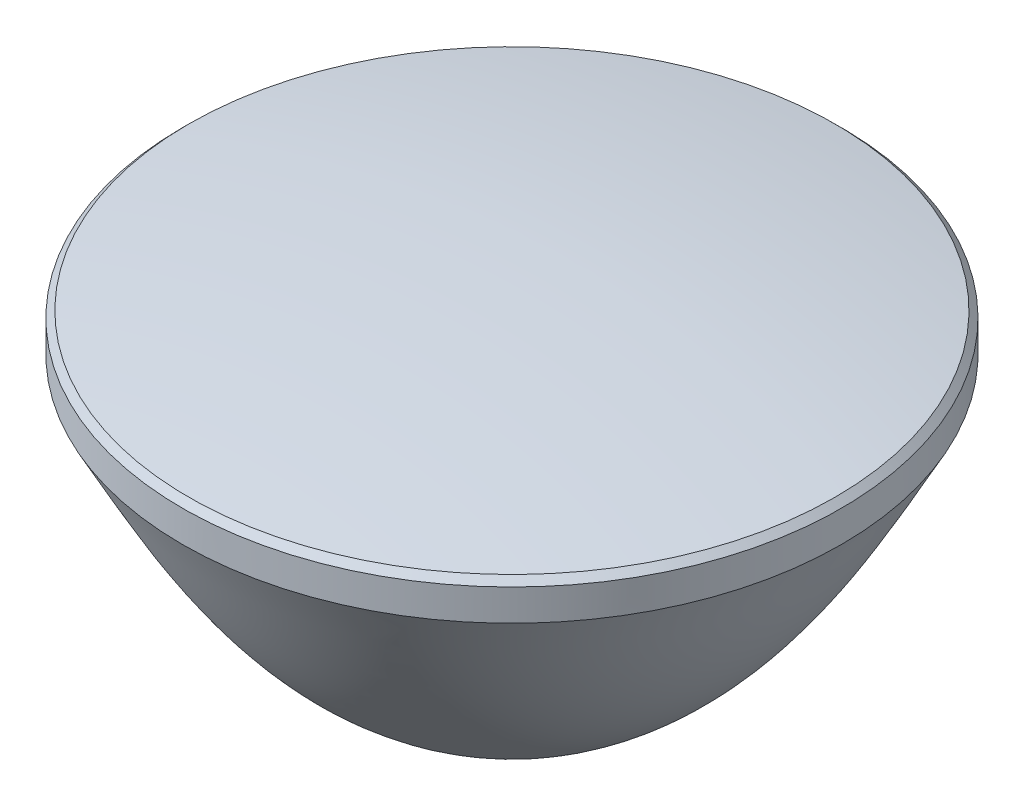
ISO-10303-21;
HEADER;
FILE_DESCRIPTION(('STEP AP214'),'2;1');
FILE_NAME('part.step','',(''),(''),'','','');
FILE_SCHEMA(('AUTOMOTIVE_DESIGN { 1 0 10303 214 1 1 1 1 }'));
ENDSEC;
DATA;
#1=APPLICATION_CONTEXT('core data for automotive mechanical design processes');
#2=APPLICATION_PROTOCOL_DEFINITION('international standard','automotive_design',2000,#1);
#3=PRODUCT_CONTEXT('',#1,'mechanical');
#4=PRODUCT('Part','Part','',(#3));
#5=PRODUCT_RELATED_PRODUCT_CATEGORY('part','',(#4));
#6=PRODUCT_DEFINITION_FORMATION('','',#4);
#7=PRODUCT_DEFINITION_CONTEXT('part definition',#1,'design');
#8=PRODUCT_DEFINITION('design','',#6,#7);
#9=PRODUCT_DEFINITION_SHAPE('','',#8);
#10=(LENGTH_UNIT() NAMED_UNIT(*) SI_UNIT(.MILLI.,.METRE.));
#11=(NAMED_UNIT(*) PLANE_ANGLE_UNIT() SI_UNIT($,.RADIAN.));
#12=(NAMED_UNIT(*) SI_UNIT($,.STERADIAN.) SOLID_ANGLE_UNIT());
#13=UNCERTAINTY_MEASURE_WITH_UNIT(LENGTH_MEASURE(1.E-05),#10,'distance_accuracy_value','');
#14=(GEOMETRIC_REPRESENTATION_CONTEXT(3) GLOBAL_UNCERTAINTY_ASSIGNED_CONTEXT((#13)) GLOBAL_UNIT_ASSIGNED_CONTEXT((#10,
#11,#12)) REPRESENTATION_CONTEXT('',''));
#15=CARTESIAN_POINT('',(0.,0.,0.));
#16=DIRECTION('',(0.,0.,1.));
#17=DIRECTION('',(1.,0.,0.));
#18=AXIS2_PLACEMENT_3D('',#15,#16,#17);
#19=CARTESIAN_POINT('',(2.0019960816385E-10,14.,0.));
#20=DIRECTION('',(0.,1.,0.));
#21=DIRECTION('',(-1.,0.,0.));
#22=AXIS2_PLACEMENT_3D('',#19,#20,#21);
#23=CYLINDRICAL_SURFACE('',#22,12.6999999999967);
#24=CARTESIAN_POINT('',(2.00199923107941E-10,11.4282863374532,0.));
#25=DIRECTION('',(0.,1.,0.));
#26=DIRECTION('',(-1.,0.,0.));
#27=AXIS2_PLACEMENT_3D('',#24,#25,#26);
#28=CIRCLE('',#27,12.6999999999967);
#29=CARTESIAN_POINT('',(-12.6999999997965,11.4282863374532,0.));
#30=VERTEX_POINT('',#29);
#31=EDGE_CURVE('E11',#30,#30,#28,.T.);
#32=ORIENTED_EDGE('',*,*,#31,.T.);
#33=EDGE_LOOP('',(#32));
#34=FACE_BOUND('',#33,.T.);
#35=CARTESIAN_POINT('',(2.00199774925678E-10,12.6382863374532,0.));
#36=DIRECTION('',(0.,1.,0.));
#37=DIRECTION('',(-1.,0.,0.));
#38=AXIS2_PLACEMENT_3D('',#35,#36,#37);
#39=CIRCLE('',#38,12.7000000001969);
#40=CARTESIAN_POINT('',(-12.6999999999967,12.6382863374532,0.));
#41=VERTEX_POINT('',#40);
#42=EDGE_CURVE('E38',#41,#41,#39,.T.);
#43=ORIENTED_EDGE('',*,*,#42,.F.);
#44=EDGE_LOOP('',(#43));
#45=FACE_BOUND('',#44,.T.);
#46=ADVANCED_FACE('F17',(#34,#45),#23,.T.);
#47=CARTESIAN_POINT('',(0.,0.,0.));
#48=CARTESIAN_POINT('',(0.065053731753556,0.,0.));
#49=CARTESIAN_POINT('',(0.195269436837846,0.0017506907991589,0.));
#50=CARTESIAN_POINT('',(0.488270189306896,0.00962874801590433,0.));
#51=CARTESIAN_POINT('',(0.741379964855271,0.0306050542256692,0.));
#52=CARTESIAN_POINT('',(1.07409762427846,0.0619892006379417,0.));
#53=CARTESIAN_POINT('',(1.3577041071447,0.103687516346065,0.));
#54=CARTESIAN_POINT('',(1.66844163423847,0.155573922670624,0.));
#55=CARTESIAN_POINT('',(1.95998957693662,0.21749890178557,0.));
#56=CARTESIAN_POINT('',(2.2597015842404,0.289279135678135,0.));
#57=CARTESIAN_POINT('',(2.55069587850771,0.370720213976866,0.));
#58=CARTESIAN_POINT('',(2.84254882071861,0.461585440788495,0.));
#59=CARTESIAN_POINT('',(3.12932504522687,0.561653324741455,0.));
#60=CARTESIAN_POINT('',(3.48495778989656,0.697880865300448,0.));
#61=CARTESIAN_POINT('',(3.90410862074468,0.878713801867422,0.));
#62=CARTESIAN_POINT('',(4.38254068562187,1.11365618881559,0.));
#63=CARTESIAN_POINT('',(4.91294921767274,1.41286859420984,0.));
#64=CARTESIAN_POINT('',(5.42643349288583,1.74019360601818,0.));
#65=CARTESIAN_POINT('',(5.9224420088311,2.09363807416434,0.));
#66=CARTESIAN_POINT('',(6.40055239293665,2.47040718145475,0.));
#67=CARTESIAN_POINT('',(6.86113542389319,2.86918499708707,0.));
#68=CARTESIAN_POINT('',(7.37128169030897,3.35033810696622,0.));
#69=CARTESIAN_POINT('',(7.96395224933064,3.96710957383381,0.));
#70=CARTESIAN_POINT('',(8.51936396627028,4.61333986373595,0.));
#71=CARTESIAN_POINT('',(9.04500836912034,5.29087908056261,0.));
#72=CARTESIAN_POINT('',(9.48682424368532,5.90433063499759,0.));
#73=CARTESIAN_POINT('',(9.83359792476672,6.41467985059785,0.));
#74=CARTESIAN_POINT('',(10.2404360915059,7.03968536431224,0.));
#75=CARTESIAN_POINT('',(10.7301806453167,7.84327691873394,0.));
#76=CARTESIAN_POINT('',(11.2373721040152,8.72353009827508,0.));
#77=CARTESIAN_POINT('',(11.7837409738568,9.72409723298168,0.));
#78=CARTESIAN_POINT('',(12.1634222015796,10.4355393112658,0.));
#79=CARTESIAN_POINT('',(12.5150150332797,11.0879897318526,0.));
#80=CARTESIAN_POINT('',(12.6375602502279,11.3141406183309,0.));
#81=CARTESIAN_POINT('',(12.700000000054,11.4282863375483,0.));
#82=B_SPLINE_CURVE_WITH_KNOTS('',4,(#47,#48,#49,#50,#51,#52,#53,#54,#55,#56,#57,#58,#59,#60,#61,
#62,#63,#64,#65,#66,#67,#68,#69,#70,#71,#72,#73,#74,#75,#76,#77,#78,#79,#80,#81),.UNSPECIFIED.,
.F.,.F.,(5,1,1,1,1,1,1,1,1,1,1,1,1,1,1,1,1,1,1,1,1,1,1,1,1,1,1,1,1,1,1,5),(0.0604532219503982,
0.074890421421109,0.0893276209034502,0.103764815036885,0.11820200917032,0.132639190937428,
0.147076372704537,0.161513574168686,0.175950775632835,0.190387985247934,0.204825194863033,
0.21926240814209,0.233699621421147,0.262574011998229,0.291448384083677,0.320322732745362,
0.349197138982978,0.378071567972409,0.40694600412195,0.435820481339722,0.464694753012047,
0.511203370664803,0.568952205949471,0.59782659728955,0.62670098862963,0.655575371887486,
0.684449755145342,0.742198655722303,0.799947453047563,0.857696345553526,0.886570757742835,
0.915445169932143),.UNSPECIFIED.);
#83=CARTESIAN_POINT('',(2.0019960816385E-10,14.,0.));
#84=DIRECTION('',(0.,1.,0.));
#85=AXIS1_PLACEMENT('',#83,#84);
#86=SURFACE_OF_REVOLUTION('',#82,#85);
#87=ORIENTED_EDGE('',*,*,#31,.F.);
#88=EDGE_LOOP('',(#87));
#89=FACE_BOUND('',#88,.T.);
#90=CARTESIAN_POINT('',(2.00201322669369E-10,0.,0.));
#91=VERTEX_POINT('',#90);
#92=VERTEX_LOOP('',#91);
#93=FACE_BOUND('',#92,.T.);
#94=ADVANCED_FACE('F19',(#89,#93),#86,.T.);
#95=CARTESIAN_POINT('',(2.00199744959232E-10,12.8829809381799,0.));
#96=DIRECTION('',(0.,-1.,0.));
#97=DIRECTION('',(1.,0.,0.));
#98=AXIS2_PLACEMENT_3D('',#95,#96,#97);
#99=CONICAL_SURFACE('',#98,12.4553053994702,0.785398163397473);
#100=ORIENTED_EDGE('',*,*,#42,.T.);
#101=EDGE_LOOP('',(#100));
#102=FACE_BOUND('',#101,.T.);
#103=CARTESIAN_POINT('',(2.00199744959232E-10,12.8829809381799,0.));
#104=DIRECTION('',(0.,1.,0.));
#105=DIRECTION('',(-1.,0.,0.));
#106=AXIS2_PLACEMENT_3D('',#103,#104,#105);
#107=CIRCLE('',#106,12.4553053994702);
#108=CARTESIAN_POINT('',(-12.45530539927,12.8829809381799,0.));
#109=VERTEX_POINT('',#108);
#110=EDGE_CURVE('E25',#109,#109,#107,.T.);
#111=ORIENTED_EDGE('',*,*,#110,.F.);
#112=EDGE_LOOP('',(#111));
#113=FACE_BOUND('',#112,.T.);
#114=ADVANCED_FACE('F34',(#102,#113),#99,.T.);
#115=CARTESIAN_POINT('',(-3.441158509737E-05,-55.9994799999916,0.));
#116=DIRECTION('',(0.,0.,-1.));
#117=DIRECTION('',(-1.,0.,0.));
#118=AXIS2_PLACEMENT_3D('',#115,#116,#117);
#119=CIRCLE('',#118,69.99948);
#120=TRIMMED_CURVE('',#119,(PARAMETER_VALUE(-1.57079681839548)),
(PARAMETER_VALUE(1.57079681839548)),.T.,.PARAMETER.);
#121=CARTESIAN_POINT('',(2.00208180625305E-10,-55.9994799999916,0.));
#122=DIRECTION('',(0.,1.,0.));
#123=AXIS1_PLACEMENT('',#121,#122);
#124=SURFACE_OF_REVOLUTION('',#120,#123);
#125=CARTESIAN_POINT('',(2.0019960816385E-10,14.,0.));
#126=VERTEX_POINT('',#125);
#127=VERTEX_LOOP('',#126);
#128=FACE_BOUND('',#127,.T.);
#129=ORIENTED_EDGE('',*,*,#110,.T.);
#130=EDGE_LOOP('',(#129));
#131=FACE_BOUND('',#130,.T.);
#132=ADVANCED_FACE('F31',(#128,#131),#124,.T.);
#133=CLOSED_SHELL('',(#46,#94,#114,#132));
#134=MANIFOLD_SOLID_BREP('B1',#133);
#135=ADVANCED_BREP_SHAPE_REPRESENTATION('',(#18,#134),#14);
#136=SHAPE_DEFINITION_REPRESENTATION(#9,#135);
ENDSEC;
END-ISO-10303-21;
